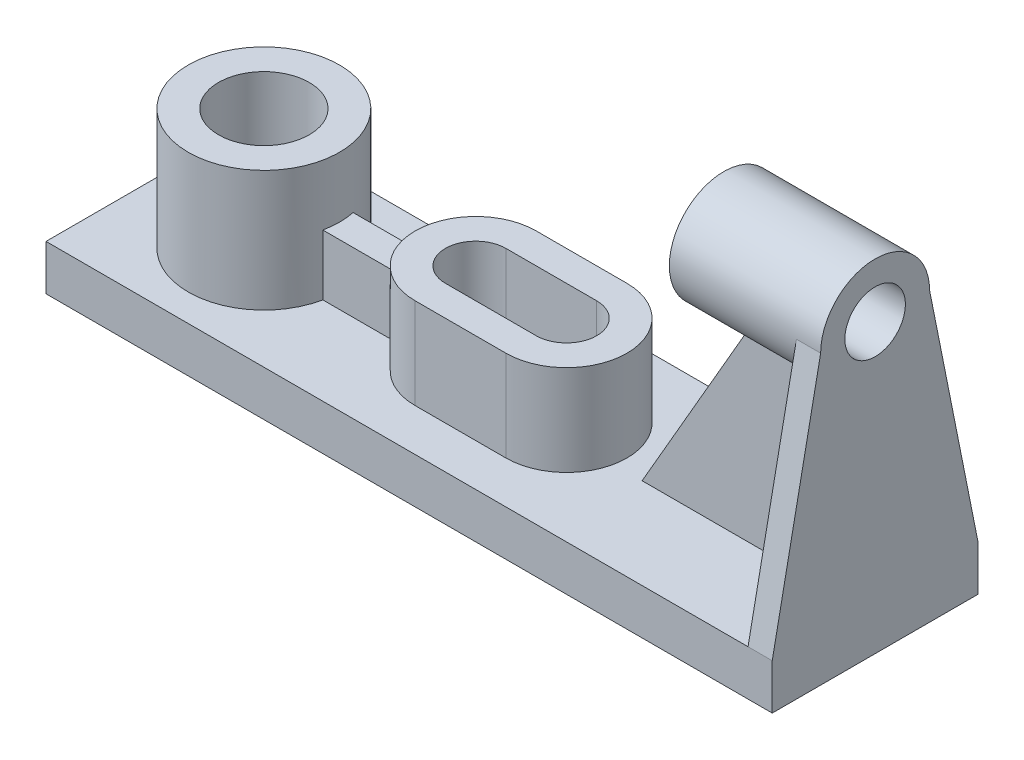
ISO-10303-21;
HEADER;
FILE_DESCRIPTION(('STEP AP214'),'2;1');
FILE_NAME('part.step','',(''),(''),'','','');
FILE_SCHEMA(('AUTOMOTIVE_DESIGN { 1 0 10303 214 1 1 1 1 }'));
ENDSEC;
DATA;
#1=APPLICATION_CONTEXT('core data for automotive mechanical design processes');
#2=APPLICATION_PROTOCOL_DEFINITION('international standard','automotive_design',2000,#1);
#3=PRODUCT_CONTEXT('',#1,'mechanical');
#4=PRODUCT('Part','Part','',(#3));
#5=PRODUCT_RELATED_PRODUCT_CATEGORY('part','',(#4));
#6=PRODUCT_DEFINITION_FORMATION('','',#4);
#7=PRODUCT_DEFINITION_CONTEXT('part definition',#1,'design');
#8=PRODUCT_DEFINITION('design','',#6,#7);
#9=PRODUCT_DEFINITION_SHAPE('','',#8);
#10=(LENGTH_UNIT() NAMED_UNIT(*) SI_UNIT(.MILLI.,.METRE.));
#11=(NAMED_UNIT(*) PLANE_ANGLE_UNIT() SI_UNIT($,.RADIAN.));
#12=(NAMED_UNIT(*) SI_UNIT($,.STERADIAN.) SOLID_ANGLE_UNIT());
#13=UNCERTAINTY_MEASURE_WITH_UNIT(LENGTH_MEASURE(1.E-05),#10,'distance_accuracy_value','');
#14=(GEOMETRIC_REPRESENTATION_CONTEXT(3) GLOBAL_UNCERTAINTY_ASSIGNED_CONTEXT((#13)) GLOBAL_UNIT_ASSIGNED_CONTEXT((#10,
#11,#12)) REPRESENTATION_CONTEXT('',''));
#15=CARTESIAN_POINT('',(0.,0.,0.));
#16=DIRECTION('',(0.,0.,1.));
#17=DIRECTION('',(1.,0.,0.));
#18=AXIS2_PLACEMENT_3D('',#15,#16,#17);
#19=CARTESIAN_POINT('',(112.,95.,0.));
#20=DIRECTION('',(1.,0.,0.));
#21=DIRECTION('',(0.,0.,-1.));
#22=AXIS2_PLACEMENT_3D('',#19,#20,#21);
#23=PLANE('',#22);
#24=DIRECTION('',(0.,-1.,0.));
#25=VECTOR('',#24,1.);
#26=CARTESIAN_POINT('',(112.,95.,-4.));
#27=LINE('',#26,#25);
#28=CARTESIAN_POINT('',(112.,77.4500712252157,-4.));
#29=VERTEX_POINT('',#28);
#30=CARTESIAN_POINT('',(112.,15.,-4.));
#31=VERTEX_POINT('',#30);
#32=EDGE_CURVE('E208',#29,#31,#27,.T.);
#33=ORIENTED_EDGE('',*,*,#32,.F.);
#34=CARTESIAN_POINT('',(112.,95.,0.));
#35=DIRECTION('',(1.,0.,0.));
#36=DIRECTION('',(0.,0.,-1.));
#37=AXIS2_PLACEMENT_3D('',#34,#35,#36);
#38=CIRCLE('',#37,18.);
#39=CARTESIAN_POINT('',(112.,95.,-18.));
#40=VERTEX_POINT('',#39);
#41=EDGE_CURVE('E12',#40,#29,#38,.F.);
#42=ORIENTED_EDGE('',*,*,#41,.F.);
#43=DIRECTION('',(0.,0.98058067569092,0.196116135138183));
#44=VECTOR('',#43,1.);
#45=CARTESIAN_POINT('',(112.,95.,-18.));
#46=LINE('',#45,#44);
#47=CARTESIAN_POINT('',(112.,15.,-34.));
#48=VERTEX_POINT('',#47);
#49=EDGE_CURVE('E258',#48,#40,#46,.T.);
#50=ORIENTED_EDGE('',*,*,#49,.F.);
#51=DIRECTION('',(0.,0.,-1.));
#52=VECTOR('',#51,1.);
#53=CARTESIAN_POINT('',(112.,15.,34.));
#54=LINE('',#53,#52);
#55=EDGE_CURVE('E75',#31,#48,#54,.T.);
#56=ORIENTED_EDGE('',*,*,#55,.F.);
#57=EDGE_LOOP('',(#33,#42,#50,#56));
#58=FACE_BOUND('',#57,.T.);
#59=ADVANCED_FACE('F51',(#58),#23,.F.);
#60=CARTESIAN_POINT('',(112.,77.4500712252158,4.));
#61=VERTEX_POINT('',#60);
#62=CARTESIAN_POINT('',(112.,95.,18.));
#63=VERTEX_POINT('',#62);
#64=EDGE_CURVE('E60',#61,#63,#38,.F.);
#65=ORIENTED_EDGE('',*,*,#64,.F.);
#66=DIRECTION('',(0.,-1.,0.));
#67=VECTOR('',#66,1.);
#68=CARTESIAN_POINT('',(112.,95.,4.));
#69=LINE('',#68,#67);
#70=CARTESIAN_POINT('',(112.,15.,4.));
#71=VERTEX_POINT('',#70);
#72=EDGE_CURVE('E652',#61,#71,#69,.T.);
#73=ORIENTED_EDGE('',*,*,#72,.T.);
#74=CARTESIAN_POINT('',(112.,15.,34.));
#75=VERTEX_POINT('',#74);
#76=EDGE_CURVE('E255',#75,#71,#54,.T.);
#77=ORIENTED_EDGE('',*,*,#76,.F.);
#78=DIRECTION('',(0.,-0.98058067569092,0.196116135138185));
#79=VECTOR('',#78,1.);
#80=CARTESIAN_POINT('',(112.,95.,18.));
#81=LINE('',#80,#79);
#82=EDGE_CURVE('E250',#63,#75,#81,.T.);
#83=ORIENTED_EDGE('',*,*,#82,.F.);
#84=EDGE_LOOP('',(#65,#73,#77,#83));
#85=FACE_BOUND('',#84,.T.);
#86=ADVANCED_FACE('F487',(#85),#23,.F.);
#87=CARTESIAN_POINT('',(0.,15.,0.));
#88=DIRECTION('',(0.,1.,0.));
#89=DIRECTION('',(0.,0.,1.));
#90=AXIS2_PLACEMENT_3D('',#87,#88,#89);
#91=PLANE('',#90);
#92=DIRECTION('',(1.,0.,0.));
#93=VECTOR('',#92,1.);
#94=CARTESIAN_POINT('',(0.,15.,4.));
#95=LINE('',#94,#93);
#96=CARTESIAN_POINT('',(47.,15.,4.));
#97=VERTEX_POINT('',#96);
#98=EDGE_CURVE('E228',#97,#71,#95,.T.);
#99=ORIENTED_EDGE('',*,*,#98,.F.);
#100=DIRECTION('',(0.,0.,1.));
#101=VECTOR('',#100,1.);
#102=CARTESIAN_POINT('',(47.,15.,0.));
#103=LINE('',#102,#101);
#104=CARTESIAN_POINT('',(47.,15.,-4.));
#105=VERTEX_POINT('',#104);
#106=EDGE_CURVE('E216',#105,#97,#103,.T.);
#107=ORIENTED_EDGE('',*,*,#106,.F.);
#108=DIRECTION('',(1.,0.,0.));
#109=VECTOR('',#108,1.);
#110=CARTESIAN_POINT('',(0.,15.,-4.));
#111=LINE('',#110,#109);
#112=EDGE_CURVE('E205',#105,#31,#111,.T.);
#113=ORIENTED_EDGE('',*,*,#112,.T.);
#114=ORIENTED_EDGE('',*,*,#55,.T.);
#115=DIRECTION('',(-1.,0.,0.));
#116=VECTOR('',#115,1.);
#117=CARTESIAN_POINT('',(-120.,15.,-34.));
#118=LINE('',#117,#116);
#119=CARTESIAN_POINT('',(-120.,15.,-34.));
#120=VERTEX_POINT('',#119);
#121=EDGE_CURVE('E423',#48,#120,#118,.T.);
#122=ORIENTED_EDGE('',*,*,#121,.T.);
#123=DIRECTION('',(0.,0.,1.));
#124=VECTOR('',#123,1.);
#125=CARTESIAN_POINT('',(-120.,15.,-34.));
#126=LINE('',#125,#124);
#127=CARTESIAN_POINT('',(-120.,15.,34.));
#128=VERTEX_POINT('',#127);
#129=EDGE_CURVE('E422',#120,#128,#126,.T.);
#130=ORIENTED_EDGE('',*,*,#129,.T.);
#131=DIRECTION('',(1.,0.,0.));
#132=VECTOR('',#131,1.);
#133=CARTESIAN_POINT('',(-120.,15.,34.));
#134=LINE('',#133,#132);
#135=EDGE_CURVE('E426',#128,#75,#134,.T.);
#136=ORIENTED_EDGE('',*,*,#135,.T.);
#137=ORIENTED_EDGE('',*,*,#76,.T.);
#138=EDGE_LOOP('',(#99,#107,#113,#114,#122,#130,#136,#137));
#139=FACE_BOUND('',#138,.T.);
#140=DIRECTION('',(1.,0.,0.));
#141=VECTOR('',#140,1.);
#142=CARTESIAN_POINT('',(0.,15.,5.));
#143=LINE('',#142,#141);
#144=CARTESIAN_POINT('',(-57.5051025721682,15.,5.));
#145=VERTEX_POINT('',#144);
#146=CARTESIAN_POINT('',(-31.3649167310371,15.,5.));
#147=VERTEX_POINT('',#146);
#148=EDGE_CURVE('E303',#145,#147,#143,.T.);
#149=ORIENTED_EDGE('',*,*,#148,.F.);
#150=CARTESIAN_POINT('',(-82.,15.,0.));
#151=DIRECTION('',(0.,1.,0.));
#152=DIRECTION('',(0.,0.,1.));
#153=AXIS2_PLACEMENT_3D('',#150,#151,#152);
#154=CIRCLE('',#153,25.);
#155=CARTESIAN_POINT('',(-57.5051025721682,15.,-5.));
#156=VERTEX_POINT('',#155);
#157=EDGE_CURVE('E410',#156,#145,#154,.T.);
#158=ORIENTED_EDGE('',*,*,#157,.F.);
#159=DIRECTION('',(1.,0.,0.));
#160=VECTOR('',#159,1.);
#161=CARTESIAN_POINT('',(0.,15.,-5.));
#162=LINE('',#161,#160);
#163=CARTESIAN_POINT('',(-31.3649167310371,15.,-5.));
#164=VERTEX_POINT('',#163);
#165=EDGE_CURVE('E291',#156,#164,#162,.T.);
#166=ORIENTED_EDGE('',*,*,#165,.T.);
#167=CARTESIAN_POINT('',(-12.,15.,0.));
#168=DIRECTION('',(0.,1.,0.));
#169=DIRECTION('',(0.,0.,1.));
#170=AXIS2_PLACEMENT_3D('',#167,#168,#169);
#171=CIRCLE('',#170,20.);
#172=CARTESIAN_POINT('',(-12.,15.,-20.));
#173=VERTEX_POINT('',#172);
#174=EDGE_CURVE('E377',#173,#164,#171,.T.);
#175=ORIENTED_EDGE('',*,*,#174,.F.);
#176=DIRECTION('',(1.,0.,0.));
#177=VECTOR('',#176,1.);
#178=CARTESIAN_POINT('',(-12.,15.,-20.));
#179=LINE('',#178,#177);
#180=CARTESIAN_POINT('',(18.,15.,-20.));
#181=VERTEX_POINT('',#180);
#182=EDGE_CURVE('E366',#173,#181,#179,.T.);
#183=ORIENTED_EDGE('',*,*,#182,.T.);
#184=CARTESIAN_POINT('',(18.,15.,0.));
#185=DIRECTION('',(0.,1.,0.));
#186=DIRECTION('',(0.,0.,1.));
#187=AXIS2_PLACEMENT_3D('',#184,#185,#186);
#188=CIRCLE('',#187,20.);
#189=CARTESIAN_POINT('',(18.,15.,20.));
#190=VERTEX_POINT('',#189);
#191=EDGE_CURVE('E384',#190,#181,#188,.T.);
#192=ORIENTED_EDGE('',*,*,#191,.F.);
#193=DIRECTION('',(1.,0.,0.));
#194=VECTOR('',#193,1.);
#195=CARTESIAN_POINT('',(-12.,15.,20.));
#196=LINE('',#195,#194);
#197=CARTESIAN_POINT('',(-12.,15.,20.));
#198=VERTEX_POINT('',#197);
#199=EDGE_CURVE('E380',#198,#190,#196,.T.);
#200=ORIENTED_EDGE('',*,*,#199,.F.);
#201=EDGE_CURVE('E360',#147,#198,#171,.T.);
#202=ORIENTED_EDGE('',*,*,#201,.F.);
#203=EDGE_LOOP('',(#149,#158,#166,#175,#183,#192,#200,#202));
#204=FACE_BOUND('',#203,.T.);
#205=ADVANCED_FACE('F225',(#139,#204),#91,.T.);
#206=CARTESIAN_POINT('',(120.,15.,-34.));
#207=DIRECTION('',(-1.,0.,0.));
#208=DIRECTION('',(0.,0.,1.));
#209=AXIS2_PLACEMENT_3D('',#206,#207,#208);
#210=PLANE('',#209);
#211=CARTESIAN_POINT('',(120.,95.,0.));
#212=DIRECTION('',(-1.,0.,0.));
#213=DIRECTION('',(0.,0.,1.));
#214=AXIS2_PLACEMENT_3D('',#211,#212,#213);
#215=CIRCLE('',#214,10.);
#216=CARTESIAN_POINT('',(120.,95.,9.99999999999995));
#217=VERTEX_POINT('',#216);
#218=EDGE_CURVE('E237',#217,#217,#215,.T.);
#219=ORIENTED_EDGE('',*,*,#218,.T.);
#220=EDGE_LOOP('',(#219));
#221=FACE_BOUND('',#220,.T.);
#222=DIRECTION('',(0.,0.,-1.));
#223=VECTOR('',#222,1.);
#224=CARTESIAN_POINT('',(120.,0.,-34.));
#225=LINE('',#224,#223);
#226=CARTESIAN_POINT('',(120.,0.,34.));
#227=VERTEX_POINT('',#226);
#228=CARTESIAN_POINT('',(120.,0.,-34.));
#229=VERTEX_POINT('',#228);
#230=EDGE_CURVE('E415',#227,#229,#225,.T.);
#231=ORIENTED_EDGE('',*,*,#230,.T.);
#232=DIRECTION('',(0.,-1.,0.));
#233=VECTOR('',#232,1.);
#234=CARTESIAN_POINT('',(120.,15.,-34.));
#235=LINE('',#234,#233);
#236=CARTESIAN_POINT('',(120.,15.,-34.));
#237=VERTEX_POINT('',#236);
#238=EDGE_CURVE('E453',#237,#229,#235,.T.);
#239=ORIENTED_EDGE('',*,*,#238,.F.);
#240=DIRECTION('',(0.,0.98058067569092,0.196116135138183));
#241=VECTOR('',#240,1.);
#242=CARTESIAN_POINT('',(120.,95.,-18.));
#243=LINE('',#242,#241);
#244=CARTESIAN_POINT('',(120.,95.,-18.));
#245=VERTEX_POINT('',#244);
#246=EDGE_CURVE('E254',#237,#245,#243,.T.);
#247=ORIENTED_EDGE('',*,*,#246,.T.);
#248=CARTESIAN_POINT('',(120.,95.,0.));
#249=DIRECTION('',(1.,0.,0.));
#250=DIRECTION('',(0.,0.,-1.));
#251=AXIS2_PLACEMENT_3D('',#248,#249,#250);
#252=CIRCLE('',#251,18.);
#253=CARTESIAN_POINT('',(120.,95.,17.9999999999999));
#254=VERTEX_POINT('',#253);
#255=EDGE_CURVE('E249',#245,#254,#252,.T.);
#256=ORIENTED_EDGE('',*,*,#255,.T.);
#257=DIRECTION('',(0.,-0.98058067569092,0.196116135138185));
#258=VECTOR('',#257,1.);
#259=CARTESIAN_POINT('',(120.,95.,17.9999999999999));
#260=LINE('',#259,#258);
#261=CARTESIAN_POINT('',(120.,15.,34.));
#262=VERTEX_POINT('',#261);
#263=EDGE_CURVE('E265',#254,#262,#260,.T.);
#264=ORIENTED_EDGE('',*,*,#263,.T.);
#265=DIRECTION('',(0.,-1.,0.));
#266=VECTOR('',#265,1.);
#267=CARTESIAN_POINT('',(120.,15.,34.));
#268=LINE('',#267,#266);
#269=EDGE_CURVE('E430',#262,#227,#268,.T.);
#270=ORIENTED_EDGE('',*,*,#269,.T.);
#271=EDGE_LOOP('',(#231,#239,#247,#256,#264,#270));
#272=FACE_BOUND('',#271,.T.);
#273=ADVANCED_FACE('F53',(#221,#272),#210,.F.);
#274=CARTESIAN_POINT('',(-120.,15.,-34.));
#275=DIRECTION('',(0.,0.,1.));
#276=DIRECTION('',(1.,0.,0.));
#277=AXIS2_PLACEMENT_3D('',#274,#275,#276);
#278=PLANE('',#277);
#279=DIRECTION('',(-1.,0.,0.));
#280=VECTOR('',#279,1.);
#281=CARTESIAN_POINT('',(-120.,0.,-34.));
#282=LINE('',#281,#280);
#283=CARTESIAN_POINT('',(-120.,0.,-34.));
#284=VERTEX_POINT('',#283);
#285=EDGE_CURVE('E433',#229,#284,#282,.T.);
#286=ORIENTED_EDGE('',*,*,#285,.T.);
#287=DIRECTION('',(0.,-1.,0.));
#288=VECTOR('',#287,1.);
#289=CARTESIAN_POINT('',(-120.,15.,-34.));
#290=LINE('',#289,#288);
#291=EDGE_CURVE('E449',#120,#284,#290,.T.);
#292=ORIENTED_EDGE('',*,*,#291,.F.);
#293=ORIENTED_EDGE('',*,*,#121,.F.);
#294=EDGE_CURVE('E418',#237,#48,#118,.T.);
#295=ORIENTED_EDGE('',*,*,#294,.F.);
#296=ORIENTED_EDGE('',*,*,#238,.T.);
#297=EDGE_LOOP('',(#286,#292,#293,#295,#296));
#298=FACE_BOUND('',#297,.T.);
#299=ADVANCED_FACE('F690',(#298),#278,.F.);
#300=CARTESIAN_POINT('',(-120.,15.,-34.));
#301=DIRECTION('',(1.,0.,0.));
#302=DIRECTION('',(0.,0.,-1.));
#303=AXIS2_PLACEMENT_3D('',#300,#301,#302);
#304=PLANE('',#303);
#305=DIRECTION('',(0.,-1.,0.));
#306=VECTOR('',#305,1.);
#307=CARTESIAN_POINT('',(-120.,15.,34.));
#308=LINE('',#307,#306);
#309=CARTESIAN_POINT('',(-120.,0.,34.));
#310=VERTEX_POINT('',#309);
#311=EDGE_CURVE('E445',#128,#310,#308,.T.);
#312=ORIENTED_EDGE('',*,*,#311,.F.);
#313=ORIENTED_EDGE('',*,*,#129,.F.);
#314=ORIENTED_EDGE('',*,*,#291,.T.);
#315=DIRECTION('',(0.,0.,1.));
#316=VECTOR('',#315,1.);
#317=CARTESIAN_POINT('',(-120.,0.,-34.));
#318=LINE('',#317,#316);
#319=EDGE_CURVE('E436',#284,#310,#318,.T.);
#320=ORIENTED_EDGE('',*,*,#319,.T.);
#321=EDGE_LOOP('',(#312,#313,#314,#320));
#322=FACE_BOUND('',#321,.T.);
#323=ADVANCED_FACE('F700',(#322),#304,.F.);
#324=CARTESIAN_POINT('',(-120.,15.,34.));
#325=DIRECTION('',(0.,0.,-1.));
#326=DIRECTION('',(-1.,0.,0.));
#327=AXIS2_PLACEMENT_3D('',#324,#325,#326);
#328=PLANE('',#327);
#329=DIRECTION('',(1.,0.,0.));
#330=VECTOR('',#329,1.);
#331=CARTESIAN_POINT('',(-120.,0.,34.));
#332=LINE('',#331,#330);
#333=EDGE_CURVE('E439',#310,#227,#332,.T.);
#334=ORIENTED_EDGE('',*,*,#333,.T.);
#335=ORIENTED_EDGE('',*,*,#269,.F.);
#336=DIRECTION('',(1.,0.,0.));
#337=VECTOR('',#336,1.);
#338=CARTESIAN_POINT('',(112.,15.,34.));
#339=LINE('',#338,#337);
#340=EDGE_CURVE('E276',#75,#262,#339,.T.);
#341=ORIENTED_EDGE('',*,*,#340,.F.);
#342=ORIENTED_EDGE('',*,*,#135,.F.);
#343=ORIENTED_EDGE('',*,*,#311,.T.);
#344=EDGE_LOOP('',(#334,#335,#341,#342,#343));
#345=FACE_BOUND('',#344,.T.);
#346=ADVANCED_FACE('F483',(#345),#328,.F.);
#347=CARTESIAN_POINT('',(0.,0.,0.));
#348=DIRECTION('',(0.,1.,0.));
#349=DIRECTION('',(0.,0.,1.));
#350=AXIS2_PLACEMENT_3D('',#347,#348,#349);
#351=PLANE('',#350);
#352=ORIENTED_EDGE('',*,*,#285,.F.);
#353=ORIENTED_EDGE('',*,*,#230,.F.);
#354=ORIENTED_EDGE('',*,*,#333,.F.);
#355=ORIENTED_EDGE('',*,*,#319,.F.);
#356=EDGE_LOOP('',(#352,#353,#354,#355));
#357=FACE_BOUND('',#356,.T.);
#358=CARTESIAN_POINT('',(-82.,0.,0.));
#359=DIRECTION('',(0.,1.,0.));
#360=DIRECTION('',(0.,0.,1.));
#361=AXIS2_PLACEMENT_3D('',#358,#359,#360);
#362=CIRCLE('',#361,15.);
#363=CARTESIAN_POINT('',(-82.,0.,15.));
#364=VERTEX_POINT('',#363);
#365=EDGE_CURVE('E405',#364,#364,#362,.T.);
#366=ORIENTED_EDGE('',*,*,#365,.T.);
#367=EDGE_LOOP('',(#366));
#368=FACE_BOUND('',#367,.T.);
#369=CARTESIAN_POINT('',(-12.,0.,0.));
#370=DIRECTION('',(0.,1.,0.));
#371=DIRECTION('',(0.,0.,1.));
#372=AXIS2_PLACEMENT_3D('',#369,#370,#371);
#373=CIRCLE('',#372,10.);
#374=CARTESIAN_POINT('',(-12.,0.,-10.));
#375=VERTEX_POINT('',#374);
#376=CARTESIAN_POINT('',(-12.,0.,10.));
#377=VERTEX_POINT('',#376);
#378=EDGE_CURVE('E357',#375,#377,#373,.T.);
#379=ORIENTED_EDGE('',*,*,#378,.T.);
#380=DIRECTION('',(1.,0.,0.));
#381=VECTOR('',#380,1.);
#382=CARTESIAN_POINT('',(0.,0.,10.));
#383=LINE('',#382,#381);
#384=CARTESIAN_POINT('',(18.,0.,10.));
#385=VERTEX_POINT('',#384);
#386=EDGE_CURVE('E337',#377,#385,#383,.T.);
#387=ORIENTED_EDGE('',*,*,#386,.T.);
#388=CARTESIAN_POINT('',(18.,0.,0.));
#389=DIRECTION('',(0.,1.,0.));
#390=DIRECTION('',(0.,0.,1.));
#391=AXIS2_PLACEMENT_3D('',#388,#389,#390);
#392=CIRCLE('',#391,10.);
#393=CARTESIAN_POINT('',(18.,0.,-10.));
#394=VERTEX_POINT('',#393);
#395=EDGE_CURVE('E350',#385,#394,#392,.T.);
#396=ORIENTED_EDGE('',*,*,#395,.T.);
#397=DIRECTION('',(-1.,0.,0.));
#398=VECTOR('',#397,1.);
#399=CARTESIAN_POINT('',(0.,0.,-10.));
#400=LINE('',#399,#398);
#401=EDGE_CURVE('E353',#394,#375,#400,.T.);
#402=ORIENTED_EDGE('',*,*,#401,.T.);
#403=EDGE_LOOP('',(#379,#387,#396,#402));
#404=FACE_BOUND('',#403,.T.);
#405=ADVANCED_FACE('F462',(#357,#368,#404),#351,.F.);
#406=CARTESIAN_POINT('',(-82.,55.,0.));
#407=DIRECTION('',(0.,1.,0.));
#408=DIRECTION('',(0.,0.,1.));
#409=AXIS2_PLACEMENT_3D('',#406,#407,#408);
#410=PLANE('',#409);
#411=CARTESIAN_POINT('',(-82.,55.,0.));
#412=DIRECTION('',(0.,1.,0.));
#413=DIRECTION('',(0.,0.,1.));
#414=AXIS2_PLACEMENT_3D('',#411,#412,#413);
#415=CIRCLE('',#414,25.);
#416=CARTESIAN_POINT('',(-82.,55.,25.));
#417=VERTEX_POINT('',#416);
#418=EDGE_CURVE('E411',#417,#417,#415,.T.);
#419=ORIENTED_EDGE('',*,*,#418,.T.);
#420=EDGE_LOOP('',(#419));
#421=FACE_BOUND('',#420,.T.);
#422=CARTESIAN_POINT('',(-82.,55.,0.));
#423=DIRECTION('',(0.,1.,0.));
#424=DIRECTION('',(0.,0.,1.));
#425=AXIS2_PLACEMENT_3D('',#422,#423,#424);
#426=CIRCLE('',#425,15.);
#427=CARTESIAN_POINT('',(-82.,55.,15.));
#428=VERTEX_POINT('',#427);
#429=EDGE_CURVE('E406',#428,#428,#426,.T.);
#430=ORIENTED_EDGE('',*,*,#429,.F.);
#431=EDGE_LOOP('',(#430));
#432=FACE_BOUND('',#431,.T.);
#433=ADVANCED_FACE('F473',(#421,#432),#410,.T.);
#434=CARTESIAN_POINT('',(-82.,55.,0.));
#435=DIRECTION('',(0.,-1.,0.));
#436=DIRECTION('',(0.,0.,-1.));
#437=AXIS2_PLACEMENT_3D('',#434,#435,#436);
#438=CYLINDRICAL_SURFACE('',#437,25.);
#439=ORIENTED_EDGE('',*,*,#157,.T.);
#440=DIRECTION('',(0.,-1.,0.));
#441=VECTOR('',#440,1.);
#442=CARTESIAN_POINT('',(-57.5051025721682,55.,5.));
#443=LINE('',#442,#441);
#444=CARTESIAN_POINT('',(-57.5051025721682,35.,5.));
#445=VERTEX_POINT('',#444);
#446=EDGE_CURVE('E307',#145,#445,#443,.F.);
#447=ORIENTED_EDGE('',*,*,#446,.T.);
#448=CARTESIAN_POINT('',(-82.,35.,0.));
#449=DIRECTION('',(0.,-1.,0.));
#450=DIRECTION('',(0.,0.,-1.));
#451=AXIS2_PLACEMENT_3D('',#448,#449,#450);
#452=CIRCLE('',#451,25.);
#453=CARTESIAN_POINT('',(-57.5051025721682,35.,-5.));
#454=VERTEX_POINT('',#453);
#455=EDGE_CURVE('E315',#445,#454,#452,.F.);
#456=ORIENTED_EDGE('',*,*,#455,.T.);
#457=DIRECTION('',(0.,-1.,0.));
#458=VECTOR('',#457,1.);
#459=CARTESIAN_POINT('',(-57.5051025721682,55.,-5.));
#460=LINE('',#459,#458);
#461=EDGE_CURVE('E295',#156,#454,#460,.F.);
#462=ORIENTED_EDGE('',*,*,#461,.F.);
#463=EDGE_LOOP('',(#439,#447,#456,#462));
#464=FACE_BOUND('',#463,.T.);
#465=ORIENTED_EDGE('',*,*,#418,.F.);
#466=EDGE_LOOP('',(#465));
#467=FACE_BOUND('',#466,.T.);
#468=ADVANCED_FACE('F469',(#464,#467),#438,.T.);
#469=CARTESIAN_POINT('',(-82.,55.,0.));
#470=DIRECTION('',(0.,-1.,0.));
#471=DIRECTION('',(0.,0.,-1.));
#472=AXIS2_PLACEMENT_3D('',#469,#470,#471);
#473=CYLINDRICAL_SURFACE('',#472,15.);
#474=ORIENTED_EDGE('',*,*,#365,.F.);
#475=EDGE_LOOP('',(#474));
#476=FACE_BOUND('',#475,.T.);
#477=ORIENTED_EDGE('',*,*,#429,.T.);
#478=EDGE_LOOP('',(#477));
#479=FACE_BOUND('',#478,.T.);
#480=ADVANCED_FACE('F465',(#476,#479),#473,.F.);
#481=CARTESIAN_POINT('',(-12.,45.,0.));
#482=DIRECTION('',(0.,-1.,0.));
#483=DIRECTION('',(0.,0.,-1.));
#484=AXIS2_PLACEMENT_3D('',#481,#482,#483);
#485=CYLINDRICAL_SURFACE('',#484,20.);
#486=CARTESIAN_POINT('',(-12.,35.,0.));
#487=DIRECTION('',(0.,-1.,0.));
#488=DIRECTION('',(0.,0.,-1.));
#489=AXIS2_PLACEMENT_3D('',#486,#487,#488);
#490=CIRCLE('',#489,20.);
#491=CARTESIAN_POINT('',(-31.3649167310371,35.,-5.));
#492=VERTEX_POINT('',#491);
#493=CARTESIAN_POINT('',(-31.3649167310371,35.,5.));
#494=VERTEX_POINT('',#493);
#495=EDGE_CURVE('E312',#492,#494,#490,.F.);
#496=ORIENTED_EDGE('',*,*,#495,.T.);
#497=DIRECTION('',(0.,-1.,0.));
#498=VECTOR('',#497,1.);
#499=CARTESIAN_POINT('',(-31.3649167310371,45.,5.));
#500=LINE('',#499,#498);
#501=EDGE_CURVE('E302',#494,#147,#500,.T.);
#502=ORIENTED_EDGE('',*,*,#501,.T.);
#503=ORIENTED_EDGE('',*,*,#201,.T.);
#504=DIRECTION('',(0.,-1.,0.));
#505=VECTOR('',#504,1.);
#506=CARTESIAN_POINT('',(-12.,45.,20.));
#507=LINE('',#506,#505);
#508=CARTESIAN_POINT('',(-12.,45.,20.));
#509=VERTEX_POINT('',#508);
#510=EDGE_CURVE('E401',#509,#198,#507,.T.);
#511=ORIENTED_EDGE('',*,*,#510,.F.);
#512=CARTESIAN_POINT('',(-12.,45.,0.));
#513=DIRECTION('',(0.,1.,0.));
#514=DIRECTION('',(0.,0.,1.));
#515=AXIS2_PLACEMENT_3D('',#512,#513,#514);
#516=CIRCLE('',#515,20.);
#517=CARTESIAN_POINT('',(-12.,45.,-20.));
#518=VERTEX_POINT('',#517);
#519=EDGE_CURVE('E361',#518,#509,#516,.T.);
#520=ORIENTED_EDGE('',*,*,#519,.F.);
#521=DIRECTION('',(0.,-1.,0.));
#522=VECTOR('',#521,1.);
#523=CARTESIAN_POINT('',(-12.,45.,-20.));
#524=LINE('',#523,#522);
#525=EDGE_CURVE('E376',#518,#173,#524,.T.);
#526=ORIENTED_EDGE('',*,*,#525,.T.);
#527=ORIENTED_EDGE('',*,*,#174,.T.);
#528=DIRECTION('',(0.,-1.,0.));
#529=VECTOR('',#528,1.);
#530=CARTESIAN_POINT('',(-31.3649167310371,45.,-5.));
#531=LINE('',#530,#529);
#532=EDGE_CURVE('E287',#492,#164,#531,.T.);
#533=ORIENTED_EDGE('',*,*,#532,.F.);
#534=EDGE_LOOP('',(#496,#502,#503,#511,#520,#526,#527,#533));
#535=FACE_BOUND('',#534,.T.);
#536=ADVANCED_FACE('F468',(#535),#485,.T.);
#537=CARTESIAN_POINT('',(-12.,45.,20.));
#538=DIRECTION('',(0.,0.,-1.));
#539=DIRECTION('',(-1.,0.,0.));
#540=AXIS2_PLACEMENT_3D('',#537,#538,#539);
#541=PLANE('',#540);
#542=ORIENTED_EDGE('',*,*,#199,.T.);
#543=DIRECTION('',(0.,-1.,0.));
#544=VECTOR('',#543,1.);
#545=CARTESIAN_POINT('',(18.,45.,20.));
#546=LINE('',#545,#544);
#547=CARTESIAN_POINT('',(18.,45.,20.));
#548=VERTEX_POINT('',#547);
#549=EDGE_CURVE('E397',#548,#190,#546,.T.);
#550=ORIENTED_EDGE('',*,*,#549,.F.);
#551=DIRECTION('',(1.,0.,0.));
#552=VECTOR('',#551,1.);
#553=CARTESIAN_POINT('',(-12.,45.,20.));
#554=LINE('',#553,#552);
#555=EDGE_CURVE('E365',#509,#548,#554,.T.);
#556=ORIENTED_EDGE('',*,*,#555,.F.);
#557=ORIENTED_EDGE('',*,*,#510,.T.);
#558=EDGE_LOOP('',(#542,#550,#556,#557));
#559=FACE_BOUND('',#558,.T.);
#560=ADVANCED_FACE('F549',(#559),#541,.F.);
#561=CARTESIAN_POINT('',(18.,45.,0.));
#562=DIRECTION('',(0.,-1.,0.));
#563=DIRECTION('',(0.,0.,-1.));
#564=AXIS2_PLACEMENT_3D('',#561,#562,#563);
#565=CYLINDRICAL_SURFACE('',#564,20.);
#566=ORIENTED_EDGE('',*,*,#191,.T.);
#567=DIRECTION('',(0.,-1.,0.));
#568=VECTOR('',#567,1.);
#569=CARTESIAN_POINT('',(18.,45.,-20.));
#570=LINE('',#569,#568);
#571=CARTESIAN_POINT('',(18.,45.,-20.));
#572=VERTEX_POINT('',#571);
#573=EDGE_CURVE('E393',#572,#181,#570,.T.);
#574=ORIENTED_EDGE('',*,*,#573,.F.);
#575=CARTESIAN_POINT('',(18.,45.,0.));
#576=DIRECTION('',(0.,1.,0.));
#577=DIRECTION('',(0.,0.,1.));
#578=AXIS2_PLACEMENT_3D('',#575,#576,#577);
#579=CIRCLE('',#578,20.);
#580=EDGE_CURVE('E369',#548,#572,#579,.T.);
#581=ORIENTED_EDGE('',*,*,#580,.F.);
#582=ORIENTED_EDGE('',*,*,#549,.T.);
#583=EDGE_LOOP('',(#566,#574,#581,#582));
#584=FACE_BOUND('',#583,.T.);
#585=ADVANCED_FACE('F545',(#584),#565,.T.);
#586=CARTESIAN_POINT('',(-12.,45.,-20.));
#587=DIRECTION('',(0.,0.,-1.));
#588=DIRECTION('',(-1.,0.,0.));
#589=AXIS2_PLACEMENT_3D('',#586,#587,#588);
#590=PLANE('',#589);
#591=ORIENTED_EDGE('',*,*,#182,.F.);
#592=ORIENTED_EDGE('',*,*,#525,.F.);
#593=DIRECTION('',(1.,0.,0.));
#594=VECTOR('',#593,1.);
#595=CARTESIAN_POINT('',(-12.,45.,-20.));
#596=LINE('',#595,#594);
#597=EDGE_CURVE('E372',#518,#572,#596,.T.);
#598=ORIENTED_EDGE('',*,*,#597,.T.);
#599=ORIENTED_EDGE('',*,*,#573,.T.);
#600=EDGE_LOOP('',(#591,#592,#598,#599));
#601=FACE_BOUND('',#600,.T.);
#602=ADVANCED_FACE('F541',(#601),#590,.T.);
#603=CARTESIAN_POINT('',(-12.,45.,0.));
#604=DIRECTION('',(0.,1.,0.));
#605=DIRECTION('',(0.,0.,1.));
#606=AXIS2_PLACEMENT_3D('',#603,#604,#605);
#607=PLANE('',#606);
#608=CARTESIAN_POINT('',(-12.,45.,0.));
#609=DIRECTION('',(0.,1.,0.));
#610=DIRECTION('',(0.,0.,1.));
#611=AXIS2_PLACEMENT_3D('',#608,#609,#610);
#612=CIRCLE('',#611,10.);
#613=CARTESIAN_POINT('',(-12.,45.,-10.));
#614=VERTEX_POINT('',#613);
#615=CARTESIAN_POINT('',(-12.,45.,10.));
#616=VERTEX_POINT('',#615);
#617=EDGE_CURVE('E318',#614,#616,#612,.T.);
#618=ORIENTED_EDGE('',*,*,#617,.F.);
#619=DIRECTION('',(-1.,0.,0.));
#620=VECTOR('',#619,1.);
#621=CARTESIAN_POINT('',(18.,45.,-10.));
#622=LINE('',#621,#620);
#623=CARTESIAN_POINT('',(18.,45.,-10.));
#624=VERTEX_POINT('',#623);
#625=EDGE_CURVE('E329',#624,#614,#622,.T.);
#626=ORIENTED_EDGE('',*,*,#625,.F.);
#627=CARTESIAN_POINT('',(18.,45.,0.));
#628=DIRECTION('',(0.,1.,0.));
#629=DIRECTION('',(0.,0.,1.));
#630=AXIS2_PLACEMENT_3D('',#627,#628,#629);
#631=CIRCLE('',#630,10.);
#632=CARTESIAN_POINT('',(18.,45.,10.));
#633=VERTEX_POINT('',#632);
#634=EDGE_CURVE('E325',#633,#624,#631,.T.);
#635=ORIENTED_EDGE('',*,*,#634,.F.);
#636=DIRECTION('',(1.,0.,0.));
#637=VECTOR('',#636,1.);
#638=CARTESIAN_POINT('',(-12.,45.,10.));
#639=LINE('',#638,#637);
#640=EDGE_CURVE('E321',#616,#633,#639,.T.);
#641=ORIENTED_EDGE('',*,*,#640,.F.);
#642=EDGE_LOOP('',(#618,#626,#635,#641));
#643=FACE_BOUND('',#642,.T.);
#644=ORIENTED_EDGE('',*,*,#519,.T.);
#645=ORIENTED_EDGE('',*,*,#555,.T.);
#646=ORIENTED_EDGE('',*,*,#580,.T.);
#647=ORIENTED_EDGE('',*,*,#597,.F.);
#648=EDGE_LOOP('',(#644,#645,#646,#647));
#649=FACE_BOUND('',#648,.T.);
#650=ADVANCED_FACE('F537',(#643,#649),#607,.T.);
#651=CARTESIAN_POINT('',(-12.,-32.,0.));
#652=DIRECTION('',(0.,1.,0.));
#653=DIRECTION('',(0.,0.,1.));
#654=AXIS2_PLACEMENT_3D('',#651,#652,#653);
#655=CYLINDRICAL_SURFACE('',#654,10.);
#656=DIRECTION('',(0.,1.,0.));
#657=VECTOR('',#656,1.);
#658=CARTESIAN_POINT('',(-12.,-32.,10.));
#659=LINE('',#658,#657);
#660=EDGE_CURVE('E333',#377,#616,#659,.T.);
#661=ORIENTED_EDGE('',*,*,#660,.F.);
#662=ORIENTED_EDGE('',*,*,#378,.F.);
#663=DIRECTION('',(0.,1.,0.));
#664=VECTOR('',#663,1.);
#665=CARTESIAN_POINT('',(-12.,-32.,-10.));
#666=LINE('',#665,#664);
#667=EDGE_CURVE('E334',#375,#614,#666,.T.);
#668=ORIENTED_EDGE('',*,*,#667,.T.);
#669=ORIENTED_EDGE('',*,*,#617,.T.);
#670=EDGE_LOOP('',(#661,#662,#668,#669));
#671=FACE_BOUND('',#670,.T.);
#672=ADVANCED_FACE('F527',(#671),#655,.F.);
#673=CARTESIAN_POINT('',(18.,-32.,-10.));
#674=DIRECTION('',(0.,0.,-1.));
#675=DIRECTION('',(-1.,0.,0.));
#676=AXIS2_PLACEMENT_3D('',#673,#674,#675);
#677=PLANE('',#676);
#678=DIRECTION('',(0.,1.,0.));
#679=VECTOR('',#678,1.);
#680=CARTESIAN_POINT('',(18.,-32.,-10.));
#681=LINE('',#680,#679);
#682=EDGE_CURVE('E338',#394,#624,#681,.T.);
#683=ORIENTED_EDGE('',*,*,#682,.T.);
#684=ORIENTED_EDGE('',*,*,#625,.T.);
#685=ORIENTED_EDGE('',*,*,#667,.F.);
#686=ORIENTED_EDGE('',*,*,#401,.F.);
#687=EDGE_LOOP('',(#683,#684,#685,#686));
#688=FACE_BOUND('',#687,.T.);
#689=ADVANCED_FACE('F523',(#688),#677,.F.);
#690=CARTESIAN_POINT('',(18.,-32.,0.));
#691=DIRECTION('',(0.,1.,0.));
#692=DIRECTION('',(0.,0.,1.));
#693=AXIS2_PLACEMENT_3D('',#690,#691,#692);
#694=CYLINDRICAL_SURFACE('',#693,10.);
#695=ORIENTED_EDGE('',*,*,#682,.F.);
#696=ORIENTED_EDGE('',*,*,#395,.F.);
#697=DIRECTION('',(0.,1.,0.));
#698=VECTOR('',#697,1.);
#699=CARTESIAN_POINT('',(18.,-32.,10.));
#700=LINE('',#699,#698);
#701=EDGE_CURVE('E341',#385,#633,#700,.T.);
#702=ORIENTED_EDGE('',*,*,#701,.T.);
#703=ORIENTED_EDGE('',*,*,#634,.T.);
#704=EDGE_LOOP('',(#695,#696,#702,#703));
#705=FACE_BOUND('',#704,.T.);
#706=ADVANCED_FACE('F526',(#705),#694,.F.);
#707=CARTESIAN_POINT('',(-12.,-32.,10.));
#708=DIRECTION('',(0.,0.,1.));
#709=DIRECTION('',(1.,0.,0.));
#710=AXIS2_PLACEMENT_3D('',#707,#708,#709);
#711=PLANE('',#710);
#712=ORIENTED_EDGE('',*,*,#660,.T.);
#713=ORIENTED_EDGE('',*,*,#640,.T.);
#714=ORIENTED_EDGE('',*,*,#701,.F.);
#715=ORIENTED_EDGE('',*,*,#386,.F.);
#716=EDGE_LOOP('',(#712,#713,#714,#715));
#717=FACE_BOUND('',#716,.T.);
#718=ADVANCED_FACE('F521',(#717),#711,.F.);
#719=CARTESIAN_POINT('',(-57.,35.,0.));
#720=DIRECTION('',(0.,-1.,0.));
#721=DIRECTION('',(1.,0.,0.));
#722=AXIS2_PLACEMENT_3D('',#719,#720,#721);
#723=PLANE('',#722);
#724=ORIENTED_EDGE('',*,*,#455,.F.);
#725=DIRECTION('',(1.,0.,0.));
#726=VECTOR('',#725,1.);
#727=CARTESIAN_POINT('',(0.,35.,5.));
#728=LINE('',#727,#726);
#729=EDGE_CURVE('E283',#445,#494,#728,.T.);
#730=ORIENTED_EDGE('',*,*,#729,.T.);
#731=ORIENTED_EDGE('',*,*,#495,.F.);
#732=DIRECTION('',(1.,0.,0.));
#733=VECTOR('',#732,1.);
#734=CARTESIAN_POINT('',(0.,35.,-5.));
#735=LINE('',#734,#733);
#736=EDGE_CURVE('E275',#454,#492,#735,.T.);
#737=ORIENTED_EDGE('',*,*,#736,.F.);
#738=EDGE_LOOP('',(#724,#730,#731,#737));
#739=FACE_BOUND('',#738,.T.);
#740=ADVANCED_FACE('F514',(#739),#723,.F.);
#741=CARTESIAN_POINT('',(0.,27.5,5.));
#742=DIRECTION('',(0.,0.,1.));
#743=DIRECTION('',(1.,0.,0.));
#744=AXIS2_PLACEMENT_3D('',#741,#742,#743);
#745=PLANE('',#744);
#746=ORIENTED_EDGE('',*,*,#446,.F.);
#747=ORIENTED_EDGE('',*,*,#148,.T.);
#748=ORIENTED_EDGE('',*,*,#501,.F.);
#749=ORIENTED_EDGE('',*,*,#729,.F.);
#750=EDGE_LOOP('',(#746,#747,#748,#749));
#751=FACE_BOUND('',#750,.T.);
#752=ADVANCED_FACE('F511',(#751),#745,.T.);
#753=CARTESIAN_POINT('',(0.,27.5,-5.));
#754=DIRECTION('',(0.,0.,1.));
#755=DIRECTION('',(1.,0.,0.));
#756=AXIS2_PLACEMENT_3D('',#753,#754,#755);
#757=PLANE('',#756);
#758=ORIENTED_EDGE('',*,*,#165,.F.);
#759=ORIENTED_EDGE('',*,*,#461,.T.);
#760=ORIENTED_EDGE('',*,*,#736,.T.);
#761=ORIENTED_EDGE('',*,*,#532,.T.);
#762=EDGE_LOOP('',(#758,#759,#760,#761));
#763=FACE_BOUND('',#762,.T.);
#764=ADVANCED_FACE('F509',(#763),#757,.F.);
#765=CARTESIAN_POINT('',(112.,95.,0.));
#766=DIRECTION('',(1.,0.,0.));
#767=DIRECTION('',(0.,0.,-1.));
#768=AXIS2_PLACEMENT_3D('',#765,#766,#767);
#769=CYLINDRICAL_SURFACE('',#768,18.);
#770=DIRECTION('',(1.,0.,0.));
#771=VECTOR('',#770,1.);
#772=CARTESIAN_POINT('',(112.,95.,18.));
#773=LINE('',#772,#771);
#774=EDGE_CURVE('E262',#63,#254,#773,.T.);
#775=ORIENTED_EDGE('',*,*,#774,.T.);
#776=ORIENTED_EDGE('',*,*,#255,.F.);
#777=DIRECTION('',(1.,0.,0.));
#778=VECTOR('',#777,1.);
#779=CARTESIAN_POINT('',(112.,95.,-18.));
#780=LINE('',#779,#778);
#781=EDGE_CURVE('E272',#40,#245,#780,.T.);
#782=ORIENTED_EDGE('',*,*,#781,.F.);
#783=ORIENTED_EDGE('',*,*,#41,.T.);
#784=DIRECTION('',(1.,0.,0.));
#785=VECTOR('',#784,1.);
#786=CARTESIAN_POINT('',(112.,77.4500712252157,-4.));
#787=LINE('',#786,#785);
#788=CARTESIAN_POINT('',(83.05556543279,77.4500712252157,-3.99999999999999));
#789=VERTEX_POINT('',#788);
#790=EDGE_CURVE('E667',#29,#789,#787,.F.);
#791=ORIENTED_EDGE('',*,*,#790,.T.);
#792=CARTESIAN_POINT('',(93.1880215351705,95.,0.));
#793=DIRECTION('',(-0.866025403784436,0.500000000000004,0.));
#794=DIRECTION('',(0.500000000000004,0.866025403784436,0.));
#795=AXIS2_PLACEMENT_3D('',#792,#793,#794);
#796=ELLIPSE('',#795,20.7846096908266,18.);
#797=CARTESIAN_POINT('',(83.05556543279,77.4500712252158,4.00000000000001));
#798=VERTEX_POINT('',#797);
#799=EDGE_CURVE('E219',#798,#789,#796,.F.);
#800=ORIENTED_EDGE('',*,*,#799,.F.);
#801=DIRECTION('',(1.,0.,0.));
#802=VECTOR('',#801,1.);
#803=CARTESIAN_POINT('',(112.,77.4500712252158,4.));
#804=LINE('',#803,#802);
#805=EDGE_CURVE('E211',#61,#798,#804,.F.);
#806=ORIENTED_EDGE('',*,*,#805,.F.);
#807=ORIENTED_EDGE('',*,*,#64,.T.);
#808=EDGE_LOOP('',(#775,#776,#782,#783,#791,#800,#806,#807));
#809=FACE_BOUND('',#808,.T.);
#810=CARTESIAN_POINT('',(70.,95.,0.));
#811=DIRECTION('',(-1.,0.,0.));
#812=DIRECTION('',(0.,0.,1.));
#813=AXIS2_PLACEMENT_3D('',#810,#811,#812);
#814=CIRCLE('',#813,18.);
#815=CARTESIAN_POINT('',(70.,95.,18.));
#816=VERTEX_POINT('',#815);
#817=EDGE_CURVE('E245',#816,#816,#814,.T.);
#818=ORIENTED_EDGE('',*,*,#817,.F.);
#819=EDGE_LOOP('',(#818));
#820=FACE_BOUND('',#819,.T.);
#821=ADVANCED_FACE('F502',(#809,#820),#769,.T.);
#822=CARTESIAN_POINT('',(112.,95.,-18.));
#823=DIRECTION('',(0.,0.196116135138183,-0.98058067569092));
#824=DIRECTION('',(0.,0.98058067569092,0.196116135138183));
#825=AXIS2_PLACEMENT_3D('',#822,#823,#824);
#826=PLANE('',#825);
#827=ORIENTED_EDGE('',*,*,#246,.F.);
#828=ORIENTED_EDGE('',*,*,#294,.T.);
#829=ORIENTED_EDGE('',*,*,#49,.T.);
#830=ORIENTED_EDGE('',*,*,#781,.T.);
#831=EDGE_LOOP('',(#827,#828,#829,#830));
#832=FACE_BOUND('',#831,.T.);
#833=ADVANCED_FACE('F498',(#832),#826,.T.);
#834=CARTESIAN_POINT('',(112.,95.,18.));
#835=DIRECTION('',(0.,0.196116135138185,0.98058067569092));
#836=DIRECTION('',(0.,-0.98058067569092,0.196116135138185));
#837=AXIS2_PLACEMENT_3D('',#834,#835,#836);
#838=PLANE('',#837);
#839=ORIENTED_EDGE('',*,*,#263,.F.);
#840=ORIENTED_EDGE('',*,*,#774,.F.);
#841=ORIENTED_EDGE('',*,*,#82,.T.);
#842=ORIENTED_EDGE('',*,*,#340,.T.);
#843=EDGE_LOOP('',(#839,#840,#841,#842));
#844=FACE_BOUND('',#843,.T.);
#845=ADVANCED_FACE('F501',(#844),#838,.T.);
#846=CARTESIAN_POINT('',(70.,95.,0.));
#847=DIRECTION('',(-1.,0.,0.));
#848=DIRECTION('',(0.,0.,1.));
#849=AXIS2_PLACEMENT_3D('',#846,#847,#848);
#850=PLANE('',#849);
#851=CARTESIAN_POINT('',(70.,95.,0.));
#852=DIRECTION('',(-1.,0.,0.));
#853=DIRECTION('',(0.,0.,1.));
#854=AXIS2_PLACEMENT_3D('',#851,#852,#853);
#855=CIRCLE('',#854,10.);
#856=CARTESIAN_POINT('',(70.,95.,9.99999999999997));
#857=VERTEX_POINT('',#856);
#858=EDGE_CURVE('E230',#857,#857,#855,.T.);
#859=ORIENTED_EDGE('',*,*,#858,.F.);
#860=EDGE_LOOP('',(#859));
#861=FACE_BOUND('',#860,.T.);
#862=ORIENTED_EDGE('',*,*,#817,.T.);
#863=EDGE_LOOP('',(#862));
#864=FACE_BOUND('',#863,.T.);
#865=ADVANCED_FACE('F496',(#861,#864),#850,.T.);
#866=CARTESIAN_POINT('',(137.,95.,0.));
#867=DIRECTION('',(-1.,0.,0.));
#868=DIRECTION('',(0.,0.,1.));
#869=AXIS2_PLACEMENT_3D('',#866,#867,#868);
#870=CYLINDRICAL_SURFACE('',#869,10.);
#871=ORIENTED_EDGE('',*,*,#218,.F.);
#872=EDGE_LOOP('',(#871));
#873=FACE_BOUND('',#872,.T.);
#874=ORIENTED_EDGE('',*,*,#858,.T.);
#875=EDGE_LOOP('',(#874));
#876=FACE_BOUND('',#875,.T.);
#877=ADVANCED_FACE('F782',(#873,#876),#870,.F.);
#878=CARTESIAN_POINT('',(82.7957166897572,77.,0.));
#879=DIRECTION('',(-0.866025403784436,0.500000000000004,0.));
#880=DIRECTION('',(-0.500000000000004,-0.866025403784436,0.));
#881=AXIS2_PLACEMENT_3D('',#878,#879,#880);
#882=PLANE('',#881);
#883=DIRECTION('',(-0.500000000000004,-0.866025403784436,0.));
#884=VECTOR('',#883,1.);
#885=CARTESIAN_POINT('',(82.7957166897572,77.,-4.));
#886=LINE('',#885,#884);
#887=EDGE_CURVE('E67',#789,#105,#886,.T.);
#888=ORIENTED_EDGE('',*,*,#887,.T.);
#889=ORIENTED_EDGE('',*,*,#106,.T.);
#890=DIRECTION('',(-0.500000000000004,-0.866025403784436,0.));
#891=VECTOR('',#890,1.);
#892=CARTESIAN_POINT('',(82.7957166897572,77.,4.));
#893=LINE('',#892,#891);
#894=EDGE_CURVE('E222',#798,#97,#893,.T.);
#895=ORIENTED_EDGE('',*,*,#894,.F.);
#896=ORIENTED_EDGE('',*,*,#799,.T.);
#897=EDGE_LOOP('',(#888,#889,#895,#896));
#898=FACE_BOUND('',#897,.T.);
#899=ADVANCED_FACE('F214',(#898),#882,.T.);
#900=CARTESIAN_POINT('',(0.,56.5,4.));
#901=DIRECTION('',(0.,0.,1.));
#902=DIRECTION('',(1.,0.,0.));
#903=AXIS2_PLACEMENT_3D('',#900,#901,#902);
#904=PLANE('',#903);
#905=ORIENTED_EDGE('',*,*,#894,.T.);
#906=ORIENTED_EDGE('',*,*,#98,.T.);
#907=ORIENTED_EDGE('',*,*,#72,.F.);
#908=ORIENTED_EDGE('',*,*,#805,.T.);
#909=EDGE_LOOP('',(#905,#906,#907,#908));
#910=FACE_BOUND('',#909,.T.);
#911=ADVANCED_FACE('F680',(#910),#904,.T.);
#912=CARTESIAN_POINT('',(0.,56.5,-4.));
#913=DIRECTION('',(0.,0.,1.));
#914=DIRECTION('',(1.,0.,0.));
#915=AXIS2_PLACEMENT_3D('',#912,#913,#914);
#916=PLANE('',#915);
#917=ORIENTED_EDGE('',*,*,#112,.F.);
#918=ORIENTED_EDGE('',*,*,#887,.F.);
#919=ORIENTED_EDGE('',*,*,#790,.F.);
#920=ORIENTED_EDGE('',*,*,#32,.T.);
#921=EDGE_LOOP('',(#917,#918,#919,#920));
#922=FACE_BOUND('',#921,.T.);
#923=ADVANCED_FACE('F206',(#922),#916,.F.);
#924=CLOSED_SHELL('',(#59,#86,#205,#273,#299,#323,#346,#405,#433,#468,#480,#536,#560,#585,#602,
#650,#672,#689,#706,#718,#740,#752,#764,#821,#833,#845,#865,#877,#899,#911,#923));
#925=MANIFOLD_SOLID_BREP('B2',#924);
#926=ADVANCED_BREP_SHAPE_REPRESENTATION('',(#18,#925),#14);
#927=SHAPE_DEFINITION_REPRESENTATION(#9,#926);
ENDSEC;
END-ISO-10303-21;
